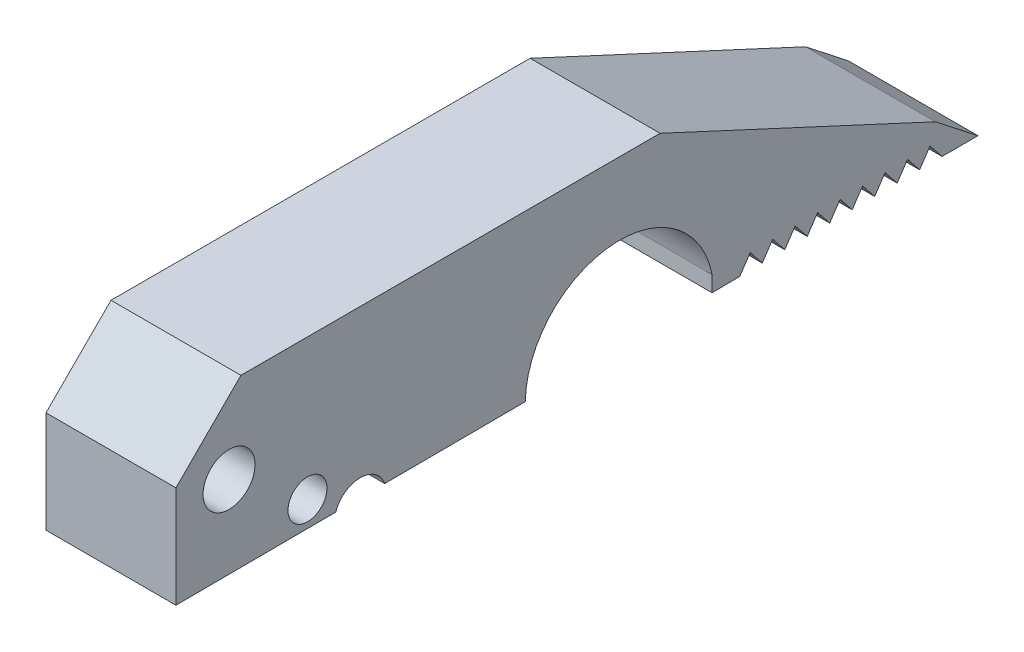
ISO-10303-21;
HEADER;
FILE_DESCRIPTION(('STEP AP214'),'2;1');
FILE_NAME('part.step','',(''),(''),'','','');
FILE_SCHEMA(('AUTOMOTIVE_DESIGN { 1 0 10303 214 1 1 1 1 }'));
ENDSEC;
DATA;
#1=APPLICATION_CONTEXT('core data for automotive mechanical design processes');
#2=APPLICATION_PROTOCOL_DEFINITION('international standard','automotive_design',2000,#1);
#3=PRODUCT_CONTEXT('',#1,'mechanical');
#4=PRODUCT('Part','Part','',(#3));
#5=PRODUCT_RELATED_PRODUCT_CATEGORY('part','',(#4));
#6=PRODUCT_DEFINITION_FORMATION('','',#4);
#7=PRODUCT_DEFINITION_CONTEXT('part definition',#1,'design');
#8=PRODUCT_DEFINITION('design','',#6,#7);
#9=PRODUCT_DEFINITION_SHAPE('','',#8);
#10=(LENGTH_UNIT() NAMED_UNIT(*) SI_UNIT(.MILLI.,.METRE.));
#11=(NAMED_UNIT(*) PLANE_ANGLE_UNIT() SI_UNIT($,.RADIAN.));
#12=(NAMED_UNIT(*) SI_UNIT($,.STERADIAN.) SOLID_ANGLE_UNIT());
#13=UNCERTAINTY_MEASURE_WITH_UNIT(LENGTH_MEASURE(1.E-05),#10,'distance_accuracy_value','');
#14=(GEOMETRIC_REPRESENTATION_CONTEXT(3) GLOBAL_UNCERTAINTY_ASSIGNED_CONTEXT((#13)) GLOBAL_UNIT_ASSIGNED_CONTEXT((#10,
#11,#12)) REPRESENTATION_CONTEXT('',''));
#15=CARTESIAN_POINT('',(0.,0.,0.));
#16=DIRECTION('',(0.,0.,1.));
#17=DIRECTION('',(1.,0.,0.));
#18=AXIS2_PLACEMENT_3D('',#15,#16,#17);
#19=CARTESIAN_POINT('',(10.,-1.40674556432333,-23.3495261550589));
#20=DIRECTION('',(-1.,0.,0.));
#21=DIRECTION('',(0.,0.,1.));
#22=AXIS2_PLACEMENT_3D('',#19,#20,#21);
#23=PLANE('',#22);
#24=DIRECTION('',(0.,0.,1.));
#25=VECTOR('',#24,1.);
#26=CARTESIAN_POINT('',(10.,11.4186627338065,10.7902319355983));
#27=LINE('',#26,#25);
#28=CARTESIAN_POINT('',(10.,11.4186627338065,-26.4654323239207));
#29=VERTEX_POINT('',#28);
#30=CARTESIAN_POINT('',(10.,11.4186627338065,5.79023193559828));
#31=VERTEX_POINT('',#30);
#32=EDGE_CURVE('E264',#29,#31,#27,.T.);
#33=ORIENTED_EDGE('',*,*,#32,.T.);
#34=DIRECTION('',(0.,0.707106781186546,-0.707106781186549));
#35=VECTOR('',#34,1.);
#36=CARTESIAN_POINT('',(10.,6.41866273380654,10.7902319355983));
#37=LINE('',#36,#35);
#38=CARTESIAN_POINT('',(10.,6.41866273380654,10.7902319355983));
#39=VERTEX_POINT('',#38);
#40=EDGE_CURVE('E11',#31,#39,#37,.F.);
#41=ORIENTED_EDGE('',*,*,#40,.T.);
#42=DIRECTION('',(0.,-1.,0.));
#43=VECTOR('',#42,1.);
#44=CARTESIAN_POINT('',(10.,1.41866273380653,10.7902319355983));
#45=LINE('',#44,#43);
#46=CARTESIAN_POINT('',(10.,-1.40674556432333,10.7902319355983));
#47=VERTEX_POINT('',#46);
#48=EDGE_CURVE('E253',#39,#47,#45,.T.);
#49=ORIENTED_EDGE('',*,*,#48,.T.);
#50=DIRECTION('',(0.,0.00465719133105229,-0.999989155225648));
#51=VECTOR('',#50,1.);
#52=CARTESIAN_POINT('',(10.,-1.40674556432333,10.7902319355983));
#53=LINE('',#52,#51);
#54=CARTESIAN_POINT('',(10.,-1.34949691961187,-1.5021605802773));
#55=VERTEX_POINT('',#54);
#56=EDGE_CURVE('E257',#47,#55,#53,.T.);
#57=ORIENTED_EDGE('',*,*,#56,.T.);
#58=CARTESIAN_POINT('',(10.,-1.99954769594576,-3.3935711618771));
#59=DIRECTION('',(-1.,0.,0.));
#60=DIRECTION('',(0.,0.,-1.));
#61=AXIS2_PLACEMENT_3D('',#58,#59,#60);
#62=CIRCLE('',#61,2.);
#63=CARTESIAN_POINT('',(10.,-1.33190798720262,-5.27884494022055));
#64=VERTEX_POINT('',#63);
#65=EDGE_CURVE('E281',#55,#64,#62,.T.);
#66=ORIENTED_EDGE('',*,*,#65,.T.);
#67=DIRECTION('',(0.,0.00465719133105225,-0.999989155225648));
#68=VECTOR('',#67,1.);
#69=CARTESIAN_POINT('',(10.,-1.33190798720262,-5.27884494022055));
#70=LINE('',#69,#68);
#71=CARTESIAN_POINT('',(10.,-1.2815478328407,-16.0921451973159));
#72=VERTEX_POINT('',#71);
#73=EDGE_CURVE('E284',#64,#72,#70,.T.);
#74=ORIENTED_EDGE('',*,*,#73,.T.);
#75=CARTESIAN_POINT('',(10.,-1.40674556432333,-23.3495261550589));
#76=DIRECTION('',(-1.,0.,0.));
#77=DIRECTION('',(0.,0.,1.));
#78=AXIS2_PLACEMENT_3D('',#75,#76,#77);
#79=CIRCLE('',#78,7.25846077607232);
#80=CARTESIAN_POINT('',(10.,0.000354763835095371,-30.4702930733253));
#81=VERTEX_POINT('',#80);
#82=EDGE_CURVE('E290',#72,#81,#79,.T.);
#83=ORIENTED_EDGE('',*,*,#82,.T.);
#84=DIRECTION('',(0.,-0.999999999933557,1.15275838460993E-05));
#85=VECTOR('',#84,1.);
#86=CARTESIAN_POINT('',(10.,-1.21458538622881,-30.4702790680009));
#87=LINE('',#86,#85);
#88=CARTESIAN_POINT('',(10.,-1.21458538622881,-30.4702790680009));
#89=VERTEX_POINT('',#88);
#90=EDGE_CURVE('E293',#81,#89,#87,.T.);
#91=ORIENTED_EDGE('',*,*,#90,.T.);
#92=DIRECTION('',(0.,0.0133625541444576,-0.999910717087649));
#93=VECTOR('',#92,1.);
#94=CARTESIAN_POINT('',(10.,-1.21458538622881,-30.4702790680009));
#95=LINE('',#94,#93);
#96=CARTESIAN_POINT('',(10.,-1.18611215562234,-32.6009112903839));
#97=VERTEX_POINT('',#96);
#98=EDGE_CURVE('E296',#89,#97,#95,.T.);
#99=ORIENTED_EDGE('',*,*,#98,.T.);
#100=DIRECTION('',(0.,0.828996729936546,-0.559253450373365));
#101=VECTOR('',#100,1.);
#102=CARTESIAN_POINT('',(10.,-1.18611215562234,-32.6009112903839));
#103=LINE('',#102,#101);
#104=CARTESIAN_POINT('',(10.,0.00290284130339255,-33.4030383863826));
#105=VERTEX_POINT('',#104);
#106=EDGE_CURVE('E299',#97,#105,#103,.T.);
#107=ORIENTED_EDGE('',*,*,#106,.T.);
#108=DIRECTION('',(0.,-0.782451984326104,-0.622710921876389));
#109=VECTOR('',#108,1.);
#110=CARTESIAN_POINT('',(10.,0.00290284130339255,-33.4030383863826));
#111=LINE('',#110,#109);
#112=CARTESIAN_POINT('',(10.,-1.16299287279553,-34.3309112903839));
#113=VERTEX_POINT('',#112);
#114=EDGE_CURVE('E302',#105,#113,#111,.T.);
#115=ORIENTED_EDGE('',*,*,#114,.T.);
#116=DIRECTION('',(0.,0.828996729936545,-0.559253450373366));
#117=VECTOR('',#116,1.);
#118=CARTESIAN_POINT('',(10.,-1.16299287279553,-34.3309112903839));
#119=LINE('',#118,#117);
#120=CARTESIAN_POINT('',(10.,0.0260221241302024,-35.1330383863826));
#121=VERTEX_POINT('',#120);
#122=EDGE_CURVE('E305',#113,#121,#119,.T.);
#123=ORIENTED_EDGE('',*,*,#122,.T.);
#124=DIRECTION('',(0.,-0.782451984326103,-0.62271092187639));
#125=VECTOR('',#124,1.);
#126=CARTESIAN_POINT('',(10.,0.0260221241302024,-35.1330383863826));
#127=LINE('',#126,#125);
#128=CARTESIAN_POINT('',(10.,-1.13987358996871,-36.0609112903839));
#129=VERTEX_POINT('',#128);
#130=EDGE_CURVE('E308',#121,#129,#127,.T.);
#131=ORIENTED_EDGE('',*,*,#130,.T.);
#132=DIRECTION('',(0.,0.828996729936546,-0.559253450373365));
#133=VECTOR('',#132,1.);
#134=CARTESIAN_POINT('',(10.,-1.13987358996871,-36.0609112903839));
#135=LINE('',#134,#133);
#136=CARTESIAN_POINT('',(10.,0.0491414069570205,-36.8630383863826));
#137=VERTEX_POINT('',#136);
#138=EDGE_CURVE('E311',#129,#137,#135,.T.);
#139=ORIENTED_EDGE('',*,*,#138,.T.);
#140=DIRECTION('',(0.,-0.782451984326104,-0.622710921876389));
#141=VECTOR('',#140,1.);
#142=CARTESIAN_POINT('',(10.,0.0491414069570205,-36.8630383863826));
#143=LINE('',#142,#141);
#144=CARTESIAN_POINT('',(10.,-1.1167543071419,-37.7909112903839));
#145=VERTEX_POINT('',#144);
#146=EDGE_CURVE('E314',#137,#145,#143,.T.);
#147=ORIENTED_EDGE('',*,*,#146,.T.);
#148=DIRECTION('',(0.,0.828996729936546,-0.559253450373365));
#149=VECTOR('',#148,1.);
#150=CARTESIAN_POINT('',(10.,-1.1167543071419,-37.7909112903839));
#151=LINE('',#150,#149);
#152=CARTESIAN_POINT('',(10.,0.0721545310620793,-38.5929667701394));
#153=VERTEX_POINT('',#152);
#154=EDGE_CURVE('E317',#145,#153,#151,.T.);
#155=ORIENTED_EDGE('',*,*,#154,.T.);
#156=DIRECTION('',(0.,-0.782451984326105,-0.622710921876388));
#157=VECTOR('',#156,1.);
#158=CARTESIAN_POINT('',(10.,0.0721545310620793,-38.5929667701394));
#159=LINE('',#158,#157);
#160=CARTESIAN_POINT('',(10.,-1.09363708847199,-39.5207568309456));
#161=VERTEX_POINT('',#160);
#162=EDGE_CURVE('E320',#153,#161,#159,.T.);
#163=ORIENTED_EDGE('',*,*,#162,.T.);
#164=DIRECTION('',(0.,0.828996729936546,-0.559253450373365));
#165=VECTOR('',#164,1.);
#166=CARTESIAN_POINT('',(10.,-1.09363708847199,-39.5207568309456));
#167=LINE('',#166,#165);
#168=CARTESIAN_POINT('',(10.,0.0952717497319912,-40.322812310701));
#169=VERTEX_POINT('',#168);
#170=EDGE_CURVE('E323',#161,#169,#167,.T.);
#171=ORIENTED_EDGE('',*,*,#170,.T.);
#172=DIRECTION('',(0.,-0.782451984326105,-0.622710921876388));
#173=VECTOR('',#172,1.);
#174=CARTESIAN_POINT('',(10.,0.0952717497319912,-40.322812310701));
#175=LINE('',#174,#173);
#176=CARTESIAN_POINT('',(10.,-1.07051986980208,-41.2506023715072));
#177=VERTEX_POINT('',#176);
#178=EDGE_CURVE('E326',#169,#177,#175,.T.);
#179=ORIENTED_EDGE('',*,*,#178,.T.);
#180=DIRECTION('',(0.,0.828996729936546,-0.559253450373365));
#181=VECTOR('',#180,1.);
#182=CARTESIAN_POINT('',(10.,-1.07051986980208,-41.2506023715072));
#183=LINE('',#182,#181);
#184=CARTESIAN_POINT('',(10.,0.118388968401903,-42.0526578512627));
#185=VERTEX_POINT('',#184);
#186=EDGE_CURVE('E329',#177,#185,#183,.T.);
#187=ORIENTED_EDGE('',*,*,#186,.T.);
#188=DIRECTION('',(0.,-0.782451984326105,-0.622710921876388));
#189=VECTOR('',#188,1.);
#190=CARTESIAN_POINT('',(10.,0.118388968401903,-42.0526578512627));
#191=LINE('',#190,#189);
#192=CARTESIAN_POINT('',(10.,-1.04740265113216,-42.9804479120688));
#193=VERTEX_POINT('',#192);
#194=EDGE_CURVE('E332',#185,#193,#191,.T.);
#195=ORIENTED_EDGE('',*,*,#194,.T.);
#196=DIRECTION('',(0.,0.828996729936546,-0.559253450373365));
#197=VECTOR('',#196,1.);
#198=CARTESIAN_POINT('',(10.,-1.04740265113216,-42.9804479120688));
#199=LINE('',#198,#197);
#200=CARTESIAN_POINT('',(10.,0.141506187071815,-43.7825033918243));
#201=VERTEX_POINT('',#200);
#202=EDGE_CURVE('E335',#193,#201,#199,.T.);
#203=ORIENTED_EDGE('',*,*,#202,.T.);
#204=DIRECTION('',(0.,-0.782451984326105,-0.622710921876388));
#205=VECTOR('',#204,1.);
#206=CARTESIAN_POINT('',(10.,0.141506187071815,-43.7825033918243));
#207=LINE('',#206,#205);
#208=CARTESIAN_POINT('',(10.,-1.02428543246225,-44.7102934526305));
#209=VERTEX_POINT('',#208);
#210=EDGE_CURVE('E338',#201,#209,#207,.T.);
#211=ORIENTED_EDGE('',*,*,#210,.T.);
#212=DIRECTION('',(0.,0.828996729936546,-0.559253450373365));
#213=VECTOR('',#212,1.);
#214=CARTESIAN_POINT('',(10.,-1.02428543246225,-44.7102934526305));
#215=LINE('',#214,#213);
#216=CARTESIAN_POINT('',(10.,0.164623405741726,-45.5123489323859));
#217=VERTEX_POINT('',#216);
#218=EDGE_CURVE('E341',#209,#217,#215,.T.);
#219=ORIENTED_EDGE('',*,*,#218,.T.);
#220=DIRECTION('',(0.,-0.782451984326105,-0.622710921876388));
#221=VECTOR('',#220,1.);
#222=CARTESIAN_POINT('',(10.,0.164623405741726,-45.5123489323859));
#223=LINE('',#222,#221);
#224=CARTESIAN_POINT('',(10.,-1.00116821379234,-46.4401389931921));
#225=VERTEX_POINT('',#224);
#226=EDGE_CURVE('E344',#217,#225,#223,.T.);
#227=ORIENTED_EDGE('',*,*,#226,.T.);
#228=DIRECTION('',(0.,0.828996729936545,-0.559253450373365));
#229=VECTOR('',#228,1.);
#230=CARTESIAN_POINT('',(10.,-1.00116821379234,-46.4401389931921));
#231=LINE('',#230,#229);
#232=CARTESIAN_POINT('',(10.,0.187740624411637,-47.2421944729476));
#233=VERTEX_POINT('',#232);
#234=EDGE_CURVE('E347',#225,#233,#231,.T.);
#235=ORIENTED_EDGE('',*,*,#234,.T.);
#236=DIRECTION('',(0.,-0.782451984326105,-0.622710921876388));
#237=VECTOR('',#236,1.);
#238=CARTESIAN_POINT('',(10.,0.187740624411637,-47.2421944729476));
#239=LINE('',#238,#237);
#240=CARTESIAN_POINT('',(10.,-0.978050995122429,-48.1699845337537));
#241=VERTEX_POINT('',#240);
#242=EDGE_CURVE('E350',#233,#241,#239,.T.);
#243=ORIENTED_EDGE('',*,*,#242,.T.);
#244=DIRECTION('',(0.,0.0133625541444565,-0.999910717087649));
#245=VECTOR('',#244,1.);
#246=CARTESIAN_POINT('',(10.,-0.978050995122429,-48.1699845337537));
#247=LINE('',#246,#245);
#248=CARTESIAN_POINT('',(10.,-0.974612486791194,-48.4272857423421));
#249=VERTEX_POINT('',#248);
#250=EDGE_CURVE('E353',#241,#249,#247,.T.);
#251=ORIENTED_EDGE('',*,*,#250,.T.);
#252=DIRECTION('',(0.,0.,-1.));
#253=VECTOR('',#252,1.);
#254=CARTESIAN_POINT('',(10.,-0.974612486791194,-48.4272857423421));
#255=LINE('',#254,#253);
#256=CARTESIAN_POINT('',(10.,-0.974612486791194,-50.9316525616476));
#257=VERTEX_POINT('',#256);
#258=EDGE_CURVE('E356',#249,#257,#255,.T.);
#259=ORIENTED_EDGE('',*,*,#258,.T.);
#260=DIRECTION('',(0.,0.61648590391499,0.787365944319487));
#261=VECTOR('',#260,1.);
#262=CARTESIAN_POINT('',(10.,1.59354352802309,-47.6516447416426));
#263=LINE('',#262,#261);
#264=CARTESIAN_POINT('',(10.,1.59354352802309,-47.6516447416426));
#265=VERTEX_POINT('',#264);
#266=EDGE_CURVE('E359',#257,#265,#263,.T.);
#267=ORIENTED_EDGE('',*,*,#266,.T.);
#268=DIRECTION('',(0.,0.420711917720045,0.907194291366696));
#269=VECTOR('',#268,1.);
#270=CARTESIAN_POINT('',(10.,1.59354352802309,-47.6516447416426));
#271=LINE('',#270,#269);
#272=EDGE_CURVE('E362',#265,#29,#271,.T.);
#273=ORIENTED_EDGE('',*,*,#272,.T.);
#274=EDGE_LOOP('',(#33,#41,#49,#57,#66,#74,#83,#91,#99,#107,#115,#123,#131,#139,#147,#155,#163,
#171,#179,#187,#195,#203,#211,#219,#227,#235,#243,#251,#259,#267,#273));
#275=FACE_BOUND('',#274,.T.);
#276=CARTESIAN_POINT('',(10.,0.593254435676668,0.667060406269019));
#277=DIRECTION('',(1.,0.,0.));
#278=DIRECTION('',(0.,0.,-1.));
#279=AXIS2_PLACEMENT_3D('',#276,#277,#278);
#280=CIRCLE('',#279,1.5);
#281=CARTESIAN_POINT('',(10.,0.593254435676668,-0.832939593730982));
#282=VERTEX_POINT('',#281);
#283=EDGE_CURVE('E369',#282,#282,#280,.T.);
#284=ORIENTED_EDGE('',*,*,#283,.F.);
#285=EDGE_LOOP('',(#284));
#286=FACE_BOUND('',#285,.T.);
#287=CARTESIAN_POINT('',(10.,4.93497379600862,6.70346901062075));
#288=DIRECTION('',(1.,0.,0.));
#289=DIRECTION('',(0.,0.,-1.));
#290=AXIS2_PLACEMENT_3D('',#287,#288,#289);
#291=CIRCLE('',#290,2.);
#292=CARTESIAN_POINT('',(10.,4.93497379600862,4.70346901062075));
#293=VERTEX_POINT('',#292);
#294=EDGE_CURVE('E712',#293,#293,#291,.T.);
#295=ORIENTED_EDGE('',*,*,#294,.F.);
#296=EDGE_LOOP('',(#295));
#297=FACE_BOUND('',#296,.T.);
#298=ADVANCED_FACE('F49',(#275,#286,#297),#23,.F.);
#299=CARTESIAN_POINT('',(0.,-1.40674556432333,-23.3495261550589));
#300=DIRECTION('',(-1.,0.,0.));
#301=DIRECTION('',(0.,0.,1.));
#302=AXIS2_PLACEMENT_3D('',#299,#300,#301);
#303=PLANE('',#302);
#304=CARTESIAN_POINT('',(0.,0.593254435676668,0.667060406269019));
#305=DIRECTION('',(1.,0.,0.));
#306=DIRECTION('',(0.,0.,-1.));
#307=AXIS2_PLACEMENT_3D('',#304,#305,#306);
#308=CIRCLE('',#307,1.5);
#309=CARTESIAN_POINT('',(0.,0.593254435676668,-0.832939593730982));
#310=VERTEX_POINT('',#309);
#311=EDGE_CURVE('E708',#310,#310,#308,.T.);
#312=ORIENTED_EDGE('',*,*,#311,.T.);
#313=EDGE_LOOP('',(#312));
#314=FACE_BOUND('',#313,.T.);
#315=DIRECTION('',(0.,-1.,0.));
#316=VECTOR('',#315,1.);
#317=CARTESIAN_POINT('',(0.,-1.40674556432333,10.7902319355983));
#318=LINE('',#317,#316);
#319=CARTESIAN_POINT('',(0.,6.41866273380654,10.7902319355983));
#320=VERTEX_POINT('',#319);
#321=CARTESIAN_POINT('',(0.,-1.40674556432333,10.7902319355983));
#322=VERTEX_POINT('',#321);
#323=EDGE_CURVE('E269',#320,#322,#318,.T.);
#324=ORIENTED_EDGE('',*,*,#323,.F.);
#325=DIRECTION('',(0.,-0.707106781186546,0.707106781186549));
#326=VECTOR('',#325,1.);
#327=CARTESIAN_POINT('',(0.,19.5758376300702,-2.36694296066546));
#328=LINE('',#327,#326);
#329=CARTESIAN_POINT('',(0.,11.4186627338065,5.79023193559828));
#330=VERTEX_POINT('',#329);
#331=EDGE_CURVE('E73',#320,#330,#328,.F.);
#332=ORIENTED_EDGE('',*,*,#331,.T.);
#333=DIRECTION('',(0.,0.,1.));
#334=VECTOR('',#333,1.);
#335=CARTESIAN_POINT('',(0.,11.4186627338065,10.7902319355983));
#336=LINE('',#335,#334);
#337=CARTESIAN_POINT('',(0.,11.4186627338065,-26.4654323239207));
#338=VERTEX_POINT('',#337);
#339=EDGE_CURVE('E366',#338,#330,#336,.T.);
#340=ORIENTED_EDGE('',*,*,#339,.F.);
#341=DIRECTION('',(0.,0.420711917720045,0.907194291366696));
#342=VECTOR('',#341,1.);
#343=CARTESIAN_POINT('',(0.,1.59354352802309,-47.6516447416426));
#344=LINE('',#343,#342);
#345=CARTESIAN_POINT('',(0.,1.59354352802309,-47.6516447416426));
#346=VERTEX_POINT('',#345);
#347=EDGE_CURVE('E453',#346,#338,#344,.T.);
#348=ORIENTED_EDGE('',*,*,#347,.F.);
#349=DIRECTION('',(0.,0.61648590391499,0.787365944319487));
#350=VECTOR('',#349,1.);
#351=CARTESIAN_POINT('',(0.,1.59354352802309,-47.6516447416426));
#352=LINE('',#351,#350);
#353=CARTESIAN_POINT('',(0.,-0.974612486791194,-50.9316525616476));
#354=VERTEX_POINT('',#353);
#355=EDGE_CURVE('E450',#354,#346,#352,.T.);
#356=ORIENTED_EDGE('',*,*,#355,.F.);
#357=DIRECTION('',(0.,0.,-1.));
#358=VECTOR('',#357,1.);
#359=CARTESIAN_POINT('',(0.,-0.974612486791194,-48.4272857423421));
#360=LINE('',#359,#358);
#361=CARTESIAN_POINT('',(0.,-0.974612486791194,-48.4272857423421));
#362=VERTEX_POINT('',#361);
#363=EDGE_CURVE('E447',#362,#354,#360,.T.);
#364=ORIENTED_EDGE('',*,*,#363,.F.);
#365=DIRECTION('',(0.,0.0133625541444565,-0.999910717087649));
#366=VECTOR('',#365,1.);
#367=CARTESIAN_POINT('',(0.,-0.978050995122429,-48.1699845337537));
#368=LINE('',#367,#366);
#369=CARTESIAN_POINT('',(0.,-0.978050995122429,-48.1699845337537));
#370=VERTEX_POINT('',#369);
#371=EDGE_CURVE('E444',#370,#362,#368,.T.);
#372=ORIENTED_EDGE('',*,*,#371,.F.);
#373=DIRECTION('',(0.,-0.782451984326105,-0.622710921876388));
#374=VECTOR('',#373,1.);
#375=CARTESIAN_POINT('',(0.,0.187740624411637,-47.2421944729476));
#376=LINE('',#375,#374);
#377=CARTESIAN_POINT('',(0.,0.187740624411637,-47.2421944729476));
#378=VERTEX_POINT('',#377);
#379=EDGE_CURVE('E441',#378,#370,#376,.T.);
#380=ORIENTED_EDGE('',*,*,#379,.F.);
#381=DIRECTION('',(0.,0.828996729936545,-0.559253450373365));
#382=VECTOR('',#381,1.);
#383=CARTESIAN_POINT('',(0.,-1.00116821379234,-46.4401389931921));
#384=LINE('',#383,#382);
#385=CARTESIAN_POINT('',(0.,-1.00116821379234,-46.4401389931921));
#386=VERTEX_POINT('',#385);
#387=EDGE_CURVE('E438',#386,#378,#384,.T.);
#388=ORIENTED_EDGE('',*,*,#387,.F.);
#389=DIRECTION('',(0.,-0.782451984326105,-0.622710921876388));
#390=VECTOR('',#389,1.);
#391=CARTESIAN_POINT('',(0.,0.164623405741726,-45.5123489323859));
#392=LINE('',#391,#390);
#393=CARTESIAN_POINT('',(0.,0.164623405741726,-45.5123489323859));
#394=VERTEX_POINT('',#393);
#395=EDGE_CURVE('E435',#394,#386,#392,.T.);
#396=ORIENTED_EDGE('',*,*,#395,.F.);
#397=DIRECTION('',(0.,0.828996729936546,-0.559253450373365));
#398=VECTOR('',#397,1.);
#399=CARTESIAN_POINT('',(0.,-1.02428543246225,-44.7102934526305));
#400=LINE('',#399,#398);
#401=CARTESIAN_POINT('',(0.,-1.02428543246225,-44.7102934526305));
#402=VERTEX_POINT('',#401);
#403=EDGE_CURVE('E432',#402,#394,#400,.T.);
#404=ORIENTED_EDGE('',*,*,#403,.F.);
#405=DIRECTION('',(0.,-0.782451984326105,-0.622710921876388));
#406=VECTOR('',#405,1.);
#407=CARTESIAN_POINT('',(0.,0.141506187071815,-43.7825033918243));
#408=LINE('',#407,#406);
#409=CARTESIAN_POINT('',(0.,0.141506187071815,-43.7825033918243));
#410=VERTEX_POINT('',#409);
#411=EDGE_CURVE('E429',#410,#402,#408,.T.);
#412=ORIENTED_EDGE('',*,*,#411,.F.);
#413=DIRECTION('',(0.,0.828996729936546,-0.559253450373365));
#414=VECTOR('',#413,1.);
#415=CARTESIAN_POINT('',(0.,-1.04740265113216,-42.9804479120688));
#416=LINE('',#415,#414);
#417=CARTESIAN_POINT('',(0.,-1.04740265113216,-42.9804479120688));
#418=VERTEX_POINT('',#417);
#419=EDGE_CURVE('E426',#418,#410,#416,.T.);
#420=ORIENTED_EDGE('',*,*,#419,.F.);
#421=DIRECTION('',(0.,-0.782451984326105,-0.622710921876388));
#422=VECTOR('',#421,1.);
#423=CARTESIAN_POINT('',(0.,0.118388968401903,-42.0526578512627));
#424=LINE('',#423,#422);
#425=CARTESIAN_POINT('',(0.,0.118388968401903,-42.0526578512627));
#426=VERTEX_POINT('',#425);
#427=EDGE_CURVE('E423',#426,#418,#424,.T.);
#428=ORIENTED_EDGE('',*,*,#427,.F.);
#429=DIRECTION('',(0.,0.828996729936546,-0.559253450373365));
#430=VECTOR('',#429,1.);
#431=CARTESIAN_POINT('',(0.,-1.07051986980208,-41.2506023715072));
#432=LINE('',#431,#430);
#433=CARTESIAN_POINT('',(0.,-1.07051986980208,-41.2506023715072));
#434=VERTEX_POINT('',#433);
#435=EDGE_CURVE('E420',#434,#426,#432,.T.);
#436=ORIENTED_EDGE('',*,*,#435,.F.);
#437=DIRECTION('',(0.,-0.782451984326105,-0.622710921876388));
#438=VECTOR('',#437,1.);
#439=CARTESIAN_POINT('',(0.,0.0952717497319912,-40.322812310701));
#440=LINE('',#439,#438);
#441=CARTESIAN_POINT('',(0.,0.0952717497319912,-40.322812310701));
#442=VERTEX_POINT('',#441);
#443=EDGE_CURVE('E417',#442,#434,#440,.T.);
#444=ORIENTED_EDGE('',*,*,#443,.F.);
#445=DIRECTION('',(0.,0.828996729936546,-0.559253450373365));
#446=VECTOR('',#445,1.);
#447=CARTESIAN_POINT('',(0.,-1.09363708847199,-39.5207568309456));
#448=LINE('',#447,#446);
#449=CARTESIAN_POINT('',(0.,-1.09363708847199,-39.5207568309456));
#450=VERTEX_POINT('',#449);
#451=EDGE_CURVE('E414',#450,#442,#448,.T.);
#452=ORIENTED_EDGE('',*,*,#451,.F.);
#453=DIRECTION('',(0.,-0.782451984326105,-0.622710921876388));
#454=VECTOR('',#453,1.);
#455=CARTESIAN_POINT('',(0.,0.0721545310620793,-38.5929667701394));
#456=LINE('',#455,#454);
#457=CARTESIAN_POINT('',(0.,0.0721545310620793,-38.5929667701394));
#458=VERTEX_POINT('',#457);
#459=EDGE_CURVE('E411',#458,#450,#456,.T.);
#460=ORIENTED_EDGE('',*,*,#459,.F.);
#461=DIRECTION('',(0.,0.828996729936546,-0.559253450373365));
#462=VECTOR('',#461,1.);
#463=CARTESIAN_POINT('',(0.,-1.1167543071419,-37.7909112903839));
#464=LINE('',#463,#462);
#465=CARTESIAN_POINT('',(0.,-1.1167543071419,-37.7909112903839));
#466=VERTEX_POINT('',#465);
#467=EDGE_CURVE('E408',#466,#458,#464,.T.);
#468=ORIENTED_EDGE('',*,*,#467,.F.);
#469=DIRECTION('',(0.,-0.782451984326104,-0.622710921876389));
#470=VECTOR('',#469,1.);
#471=CARTESIAN_POINT('',(0.,0.0491414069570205,-36.8630383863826));
#472=LINE('',#471,#470);
#473=CARTESIAN_POINT('',(0.,0.0491414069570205,-36.8630383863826));
#474=VERTEX_POINT('',#473);
#475=EDGE_CURVE('E405',#474,#466,#472,.T.);
#476=ORIENTED_EDGE('',*,*,#475,.F.);
#477=DIRECTION('',(0.,0.828996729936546,-0.559253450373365));
#478=VECTOR('',#477,1.);
#479=CARTESIAN_POINT('',(0.,-1.13987358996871,-36.0609112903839));
#480=LINE('',#479,#478);
#481=CARTESIAN_POINT('',(0.,-1.13987358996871,-36.0609112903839));
#482=VERTEX_POINT('',#481);
#483=EDGE_CURVE('E402',#482,#474,#480,.T.);
#484=ORIENTED_EDGE('',*,*,#483,.F.);
#485=DIRECTION('',(0.,-0.782451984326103,-0.62271092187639));
#486=VECTOR('',#485,1.);
#487=CARTESIAN_POINT('',(0.,0.0260221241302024,-35.1330383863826));
#488=LINE('',#487,#486);
#489=CARTESIAN_POINT('',(0.,0.0260221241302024,-35.1330383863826));
#490=VERTEX_POINT('',#489);
#491=EDGE_CURVE('E399',#490,#482,#488,.T.);
#492=ORIENTED_EDGE('',*,*,#491,.F.);
#493=DIRECTION('',(0.,0.828996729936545,-0.559253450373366));
#494=VECTOR('',#493,1.);
#495=CARTESIAN_POINT('',(0.,-1.16299287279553,-34.3309112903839));
#496=LINE('',#495,#494);
#497=CARTESIAN_POINT('',(0.,-1.16299287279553,-34.3309112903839));
#498=VERTEX_POINT('',#497);
#499=EDGE_CURVE('E396',#498,#490,#496,.T.);
#500=ORIENTED_EDGE('',*,*,#499,.F.);
#501=DIRECTION('',(0.,-0.782451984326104,-0.622710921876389));
#502=VECTOR('',#501,1.);
#503=CARTESIAN_POINT('',(0.,0.00290284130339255,-33.4030383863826));
#504=LINE('',#503,#502);
#505=CARTESIAN_POINT('',(0.,0.00290284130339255,-33.4030383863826));
#506=VERTEX_POINT('',#505);
#507=EDGE_CURVE('E393',#506,#498,#504,.T.);
#508=ORIENTED_EDGE('',*,*,#507,.F.);
#509=DIRECTION('',(0.,0.828996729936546,-0.559253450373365));
#510=VECTOR('',#509,1.);
#511=CARTESIAN_POINT('',(0.,-1.18611215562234,-32.6009112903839));
#512=LINE('',#511,#510);
#513=CARTESIAN_POINT('',(0.,-1.18611215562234,-32.6009112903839));
#514=VERTEX_POINT('',#513);
#515=EDGE_CURVE('E390',#514,#506,#512,.T.);
#516=ORIENTED_EDGE('',*,*,#515,.F.);
#517=DIRECTION('',(0.,0.0133625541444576,-0.999910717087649));
#518=VECTOR('',#517,1.);
#519=CARTESIAN_POINT('',(0.,-1.21458538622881,-30.4702790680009));
#520=LINE('',#519,#518);
#521=CARTESIAN_POINT('',(0.,-1.21458538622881,-30.4702790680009));
#522=VERTEX_POINT('',#521);
#523=EDGE_CURVE('E387',#522,#514,#520,.T.);
#524=ORIENTED_EDGE('',*,*,#523,.F.);
#525=DIRECTION('',(0.,-0.999999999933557,1.15275838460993E-05));
#526=VECTOR('',#525,1.);
#527=CARTESIAN_POINT('',(0.,-1.21458538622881,-30.4702790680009));
#528=LINE('',#527,#526);
#529=CARTESIAN_POINT('',(0.,0.000354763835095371,-30.4702930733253));
#530=VERTEX_POINT('',#529);
#531=EDGE_CURVE('E384',#530,#522,#528,.T.);
#532=ORIENTED_EDGE('',*,*,#531,.F.);
#533=CARTESIAN_POINT('',(0.,-1.40674556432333,-23.3495261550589));
#534=DIRECTION('',(-1.,0.,0.));
#535=DIRECTION('',(0.,0.,1.));
#536=AXIS2_PLACEMENT_3D('',#533,#534,#535);
#537=CIRCLE('',#536,7.25846077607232);
#538=CARTESIAN_POINT('',(0.,-1.2815478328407,-16.0921451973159));
#539=VERTEX_POINT('',#538);
#540=EDGE_CURVE('E381',#539,#530,#537,.T.);
#541=ORIENTED_EDGE('',*,*,#540,.F.);
#542=DIRECTION('',(0.,0.00465719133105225,-0.999989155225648));
#543=VECTOR('',#542,1.);
#544=CARTESIAN_POINT('',(0.,-1.33190798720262,-5.27884494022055));
#545=LINE('',#544,#543);
#546=CARTESIAN_POINT('',(0.,-1.33190798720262,-5.27884494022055));
#547=VERTEX_POINT('',#546);
#548=EDGE_CURVE('E378',#547,#539,#545,.T.);
#549=ORIENTED_EDGE('',*,*,#548,.F.);
#550=CARTESIAN_POINT('',(0.,-1.99954769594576,-3.3935711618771));
#551=DIRECTION('',(-1.,0.,0.));
#552=DIRECTION('',(0.,0.,1.));
#553=AXIS2_PLACEMENT_3D('',#550,#551,#552);
#554=CIRCLE('',#553,2.);
#555=CARTESIAN_POINT('',(0.,-1.34949691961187,-1.5021605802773));
#556=VERTEX_POINT('',#555);
#557=EDGE_CURVE('E375',#556,#547,#554,.T.);
#558=ORIENTED_EDGE('',*,*,#557,.F.);
#559=DIRECTION('',(0.,0.00465719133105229,-0.999989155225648));
#560=VECTOR('',#559,1.);
#561=CARTESIAN_POINT('',(0.,-1.40674556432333,10.7902319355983));
#562=LINE('',#561,#560);
#563=EDGE_CURVE('E372',#322,#556,#562,.T.);
#564=ORIENTED_EDGE('',*,*,#563,.F.);
#565=EDGE_LOOP('',(#324,#332,#340,#348,#356,#364,#372,#380,#388,#396,#404,#412,#420,#428,#436,
#444,#452,#460,#468,#476,#484,#492,#500,#508,#516,#524,#532,#541,#549,#558,#564));
#566=FACE_BOUND('',#565,.T.);
#567=CARTESIAN_POINT('',(0.,4.93497379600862,6.70346901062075));
#568=DIRECTION('',(1.,0.,0.));
#569=DIRECTION('',(0.,0.,-1.));
#570=AXIS2_PLACEMENT_3D('',#567,#568,#569);
#571=CIRCLE('',#570,2.);
#572=CARTESIAN_POINT('',(0.,4.93497379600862,4.70346901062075));
#573=VERTEX_POINT('',#572);
#574=EDGE_CURVE('E716',#573,#573,#571,.T.);
#575=ORIENTED_EDGE('',*,*,#574,.T.);
#576=EDGE_LOOP('',(#575));
#577=FACE_BOUND('',#576,.T.);
#578=ADVANCED_FACE('F570',(#314,#566,#577),#303,.T.);
#579=CARTESIAN_POINT('',(10.,11.4186627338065,10.7902319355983));
#580=DIRECTION('',(0.,-1.,0.));
#581=DIRECTION('',(0.,0.,-1.));
#582=AXIS2_PLACEMENT_3D('',#579,#580,#581);
#583=PLANE('',#582);
#584=ORIENTED_EDGE('',*,*,#339,.T.);
#585=DIRECTION('',(1.,0.,0.));
#586=VECTOR('',#585,1.);
#587=CARTESIAN_POINT('',(10.,11.4186627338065,5.79023193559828));
#588=LINE('',#587,#586);
#589=EDGE_CURVE('E59',#330,#31,#588,.T.);
#590=ORIENTED_EDGE('',*,*,#589,.T.);
#591=ORIENTED_EDGE('',*,*,#32,.F.);
#592=DIRECTION('',(-1.,0.,0.));
#593=VECTOR('',#592,1.);
#594=CARTESIAN_POINT('',(10.,11.4186627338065,-26.4654323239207));
#595=LINE('',#594,#593);
#596=EDGE_CURVE('E365',#29,#338,#595,.T.);
#597=ORIENTED_EDGE('',*,*,#596,.T.);
#598=EDGE_LOOP('',(#584,#590,#591,#597));
#599=FACE_BOUND('',#598,.T.);
#600=ADVANCED_FACE('F705',(#599),#583,.F.);
#601=CARTESIAN_POINT('',(10.,-1.40674556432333,10.7902319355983));
#602=DIRECTION('',(0.,0.,-1.));
#603=DIRECTION('',(0.,1.,0.));
#604=AXIS2_PLACEMENT_3D('',#601,#602,#603);
#605=PLANE('',#604);
#606=ORIENTED_EDGE('',*,*,#48,.F.);
#607=DIRECTION('',(-1.,0.,0.));
#608=VECTOR('',#607,1.);
#609=CARTESIAN_POINT('',(10.,6.41866273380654,10.7902319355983));
#610=LINE('',#609,#608);
#611=EDGE_CURVE('E274',#39,#320,#610,.T.);
#612=ORIENTED_EDGE('',*,*,#611,.T.);
#613=ORIENTED_EDGE('',*,*,#323,.T.);
#614=DIRECTION('',(-1.,0.,0.));
#615=VECTOR('',#614,1.);
#616=CARTESIAN_POINT('',(10.,-1.40674556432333,10.7902319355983));
#617=LINE('',#616,#615);
#618=EDGE_CURVE('E267',#47,#322,#617,.T.);
#619=ORIENTED_EDGE('',*,*,#618,.F.);
#620=EDGE_LOOP('',(#606,#612,#613,#619));
#621=FACE_BOUND('',#620,.T.);
#622=ADVANCED_FACE('F268',(#621),#605,.F.);
#623=CARTESIAN_POINT('',(10.,-1.40674556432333,10.7902319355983));
#624=DIRECTION('',(0.,0.999989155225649,0.00465719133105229));
#625=DIRECTION('',(0.,-0.00465719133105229,0.999989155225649));
#626=AXIS2_PLACEMENT_3D('',#623,#624,#625);
#627=PLANE('',#626);
#628=ORIENTED_EDGE('',*,*,#563,.T.);
#629=DIRECTION('',(-1.,0.,0.));
#630=VECTOR('',#629,1.);
#631=CARTESIAN_POINT('',(10.,-1.34949691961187,-1.5021605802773));
#632=LINE('',#631,#630);
#633=EDGE_CURVE('E275',#55,#556,#632,.T.);
#634=ORIENTED_EDGE('',*,*,#633,.F.);
#635=ORIENTED_EDGE('',*,*,#56,.F.);
#636=ORIENTED_EDGE('',*,*,#618,.T.);
#637=EDGE_LOOP('',(#628,#634,#635,#636));
#638=FACE_BOUND('',#637,.T.);
#639=ADVANCED_FACE('F277',(#638),#627,.F.);
#640=CARTESIAN_POINT('',(10.,-1.99954769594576,-3.3935711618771));
#641=DIRECTION('',(-1.,0.,0.));
#642=DIRECTION('',(0.,0.,1.));
#643=AXIS2_PLACEMENT_3D('',#640,#641,#642);
#644=CYLINDRICAL_SURFACE('',#643,2.);
#645=ORIENTED_EDGE('',*,*,#557,.T.);
#646=DIRECTION('',(-1.,0.,0.));
#647=VECTOR('',#646,1.);
#648=CARTESIAN_POINT('',(10.,-1.33190798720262,-5.27884494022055));
#649=LINE('',#648,#647);
#650=EDGE_CURVE('E559',#64,#547,#649,.T.);
#651=ORIENTED_EDGE('',*,*,#650,.F.);
#652=ORIENTED_EDGE('',*,*,#65,.F.);
#653=ORIENTED_EDGE('',*,*,#633,.T.);
#654=EDGE_LOOP('',(#645,#651,#652,#653));
#655=FACE_BOUND('',#654,.T.);
#656=ADVANCED_FACE('F574',(#655),#644,.F.);
#657=CARTESIAN_POINT('',(10.,-1.33190798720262,-5.27884494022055));
#658=DIRECTION('',(0.,0.999989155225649,0.00465719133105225));
#659=DIRECTION('',(0.,-0.00465719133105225,0.999989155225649));
#660=AXIS2_PLACEMENT_3D('',#657,#658,#659);
#661=PLANE('',#660);
#662=ORIENTED_EDGE('',*,*,#548,.T.);
#663=DIRECTION('',(-1.,0.,0.));
#664=VECTOR('',#663,1.);
#665=CARTESIAN_POINT('',(10.,-1.2815478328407,-16.0921451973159));
#666=LINE('',#665,#664);
#667=EDGE_CURVE('E555',#72,#539,#666,.T.);
#668=ORIENTED_EDGE('',*,*,#667,.F.);
#669=ORIENTED_EDGE('',*,*,#73,.F.);
#670=ORIENTED_EDGE('',*,*,#650,.T.);
#671=EDGE_LOOP('',(#662,#668,#669,#670));
#672=FACE_BOUND('',#671,.T.);
#673=ADVANCED_FACE('F581',(#672),#661,.F.);
#674=CARTESIAN_POINT('',(10.,-1.40674556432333,-23.3495261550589));
#675=DIRECTION('',(-1.,0.,0.));
#676=DIRECTION('',(0.,0.,1.));
#677=AXIS2_PLACEMENT_3D('',#674,#675,#676);
#678=CYLINDRICAL_SURFACE('',#677,7.25846077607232);
#679=ORIENTED_EDGE('',*,*,#540,.T.);
#680=DIRECTION('',(-1.,0.,0.));
#681=VECTOR('',#680,1.);
#682=CARTESIAN_POINT('',(10.,0.000354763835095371,-30.4702930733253));
#683=LINE('',#682,#681);
#684=EDGE_CURVE('E551',#81,#530,#683,.T.);
#685=ORIENTED_EDGE('',*,*,#684,.F.);
#686=ORIENTED_EDGE('',*,*,#82,.F.);
#687=ORIENTED_EDGE('',*,*,#667,.T.);
#688=EDGE_LOOP('',(#679,#685,#686,#687));
#689=FACE_BOUND('',#688,.T.);
#690=ADVANCED_FACE('F584',(#689),#678,.F.);
#691=CARTESIAN_POINT('',(10.,-1.21458538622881,-30.4702790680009));
#692=DIRECTION('',(0.,-1.15275838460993E-05,-0.999999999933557));
#693=DIRECTION('',(0.,0.999999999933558,-1.15275838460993E-05));
#694=AXIS2_PLACEMENT_3D('',#691,#692,#693);
#695=PLANE('',#694);
#696=ORIENTED_EDGE('',*,*,#531,.T.);
#697=DIRECTION('',(-1.,0.,0.));
#698=VECTOR('',#697,1.);
#699=CARTESIAN_POINT('',(10.,-1.21458538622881,-30.4702790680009));
#700=LINE('',#699,#698);
#701=EDGE_CURVE('E547',#89,#522,#700,.T.);
#702=ORIENTED_EDGE('',*,*,#701,.F.);
#703=ORIENTED_EDGE('',*,*,#90,.F.);
#704=ORIENTED_EDGE('',*,*,#684,.T.);
#705=EDGE_LOOP('',(#696,#702,#703,#704));
#706=FACE_BOUND('',#705,.T.);
#707=ADVANCED_FACE('F589',(#706),#695,.F.);
#708=CARTESIAN_POINT('',(10.,-1.21458538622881,-30.4702790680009));
#709=DIRECTION('',(0.,0.999910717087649,0.0133625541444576));
#710=DIRECTION('',(0.,-0.0133625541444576,0.999910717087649));
#711=AXIS2_PLACEMENT_3D('',#708,#709,#710);
#712=PLANE('',#711);
#713=ORIENTED_EDGE('',*,*,#523,.T.);
#714=DIRECTION('',(-1.,0.,0.));
#715=VECTOR('',#714,1.);
#716=CARTESIAN_POINT('',(10.,-1.18611215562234,-32.6009112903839));
#717=LINE('',#716,#715);
#718=EDGE_CURVE('E543',#97,#514,#717,.T.);
#719=ORIENTED_EDGE('',*,*,#718,.F.);
#720=ORIENTED_EDGE('',*,*,#98,.F.);
#721=ORIENTED_EDGE('',*,*,#701,.T.);
#722=EDGE_LOOP('',(#713,#719,#720,#721));
#723=FACE_BOUND('',#722,.T.);
#724=ADVANCED_FACE('F595',(#723),#712,.F.);
#725=CARTESIAN_POINT('',(10.,-1.18611215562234,-32.6009112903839));
#726=DIRECTION('',(0.,0.559253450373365,0.828996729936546));
#727=DIRECTION('',(0.,-0.828996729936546,0.559253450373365));
#728=AXIS2_PLACEMENT_3D('',#725,#726,#727);
#729=PLANE('',#728);
#730=ORIENTED_EDGE('',*,*,#515,.T.);
#731=DIRECTION('',(-1.,0.,0.));
#732=VECTOR('',#731,1.);
#733=CARTESIAN_POINT('',(10.,0.00290284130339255,-33.4030383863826));
#734=LINE('',#733,#732);
#735=EDGE_CURVE('E539',#105,#506,#734,.T.);
#736=ORIENTED_EDGE('',*,*,#735,.F.);
#737=ORIENTED_EDGE('',*,*,#106,.F.);
#738=ORIENTED_EDGE('',*,*,#718,.T.);
#739=EDGE_LOOP('',(#730,#736,#737,#738));
#740=FACE_BOUND('',#739,.T.);
#741=ADVANCED_FACE('F599',(#740),#729,.F.);
#742=CARTESIAN_POINT('',(10.,0.00290284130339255,-33.4030383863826));
#743=DIRECTION('',(0.,0.622710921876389,-0.782451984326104));
#744=DIRECTION('',(0.,0.782451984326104,0.622710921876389));
#745=AXIS2_PLACEMENT_3D('',#742,#743,#744);
#746=PLANE('',#745);
#747=ORIENTED_EDGE('',*,*,#507,.T.);
#748=DIRECTION('',(-1.,0.,0.));
#749=VECTOR('',#748,1.);
#750=CARTESIAN_POINT('',(10.,-1.16299287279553,-34.3309112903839));
#751=LINE('',#750,#749);
#752=EDGE_CURVE('E535',#113,#498,#751,.T.);
#753=ORIENTED_EDGE('',*,*,#752,.F.);
#754=ORIENTED_EDGE('',*,*,#114,.F.);
#755=ORIENTED_EDGE('',*,*,#735,.T.);
#756=EDGE_LOOP('',(#747,#753,#754,#755));
#757=FACE_BOUND('',#756,.T.);
#758=ADVANCED_FACE('F604',(#757),#746,.F.);
#759=CARTESIAN_POINT('',(10.,-1.16299287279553,-34.3309112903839));
#760=DIRECTION('',(0.,0.559253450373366,0.828996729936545));
#761=DIRECTION('',(0.,-0.828996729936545,0.559253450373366));
#762=AXIS2_PLACEMENT_3D('',#759,#760,#761);
#763=PLANE('',#762);
#764=ORIENTED_EDGE('',*,*,#499,.T.);
#765=DIRECTION('',(-1.,0.,0.));
#766=VECTOR('',#765,1.);
#767=CARTESIAN_POINT('',(10.,0.0260221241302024,-35.1330383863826));
#768=LINE('',#767,#766);
#769=EDGE_CURVE('E531',#121,#490,#768,.T.);
#770=ORIENTED_EDGE('',*,*,#769,.F.);
#771=ORIENTED_EDGE('',*,*,#122,.F.);
#772=ORIENTED_EDGE('',*,*,#752,.T.);
#773=EDGE_LOOP('',(#764,#770,#771,#772));
#774=FACE_BOUND('',#773,.T.);
#775=ADVANCED_FACE('F610',(#774),#763,.F.);
#776=CARTESIAN_POINT('',(10.,0.0260221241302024,-35.1330383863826));
#777=DIRECTION('',(0.,0.62271092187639,-0.782451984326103));
#778=DIRECTION('',(0.,0.782451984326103,0.622710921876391));
#779=AXIS2_PLACEMENT_3D('',#776,#777,#778);
#780=PLANE('',#779);
#781=ORIENTED_EDGE('',*,*,#491,.T.);
#782=DIRECTION('',(-1.,0.,0.));
#783=VECTOR('',#782,1.);
#784=CARTESIAN_POINT('',(10.,-1.13987358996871,-36.0609112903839));
#785=LINE('',#784,#783);
#786=EDGE_CURVE('E527',#129,#482,#785,.T.);
#787=ORIENTED_EDGE('',*,*,#786,.F.);
#788=ORIENTED_EDGE('',*,*,#130,.F.);
#789=ORIENTED_EDGE('',*,*,#769,.T.);
#790=EDGE_LOOP('',(#781,#787,#788,#789));
#791=FACE_BOUND('',#790,.T.);
#792=ADVANCED_FACE('F614',(#791),#780,.F.);
#793=CARTESIAN_POINT('',(10.,-1.13987358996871,-36.0609112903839));
#794=DIRECTION('',(0.,0.559253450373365,0.828996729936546));
#795=DIRECTION('',(0.,-0.828996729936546,0.559253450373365));
#796=AXIS2_PLACEMENT_3D('',#793,#794,#795);
#797=PLANE('',#796);
#798=ORIENTED_EDGE('',*,*,#483,.T.);
#799=DIRECTION('',(-1.,0.,0.));
#800=VECTOR('',#799,1.);
#801=CARTESIAN_POINT('',(10.,0.0491414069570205,-36.8630383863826));
#802=LINE('',#801,#800);
#803=EDGE_CURVE('E523',#137,#474,#802,.T.);
#804=ORIENTED_EDGE('',*,*,#803,.F.);
#805=ORIENTED_EDGE('',*,*,#138,.F.);
#806=ORIENTED_EDGE('',*,*,#786,.T.);
#807=EDGE_LOOP('',(#798,#804,#805,#806));
#808=FACE_BOUND('',#807,.T.);
#809=ADVANCED_FACE('F619',(#808),#797,.F.);
#810=CARTESIAN_POINT('',(10.,0.0491414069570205,-36.8630383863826));
#811=DIRECTION('',(0.,0.622710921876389,-0.782451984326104));
#812=DIRECTION('',(0.,0.782451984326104,0.622710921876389));
#813=AXIS2_PLACEMENT_3D('',#810,#811,#812);
#814=PLANE('',#813);
#815=ORIENTED_EDGE('',*,*,#475,.T.);
#816=DIRECTION('',(-1.,0.,0.));
#817=VECTOR('',#816,1.);
#818=CARTESIAN_POINT('',(10.,-1.1167543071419,-37.7909112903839));
#819=LINE('',#818,#817);
#820=EDGE_CURVE('E519',#145,#466,#819,.T.);
#821=ORIENTED_EDGE('',*,*,#820,.F.);
#822=ORIENTED_EDGE('',*,*,#146,.F.);
#823=ORIENTED_EDGE('',*,*,#803,.T.);
#824=EDGE_LOOP('',(#815,#821,#822,#823));
#825=FACE_BOUND('',#824,.T.);
#826=ADVANCED_FACE('F625',(#825),#814,.F.);
#827=CARTESIAN_POINT('',(10.,-1.1167543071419,-37.7909112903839));
#828=DIRECTION('',(0.,0.559253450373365,0.828996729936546));
#829=DIRECTION('',(0.,-0.828996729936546,0.559253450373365));
#830=AXIS2_PLACEMENT_3D('',#827,#828,#829);
#831=PLANE('',#830);
#832=ORIENTED_EDGE('',*,*,#467,.T.);
#833=DIRECTION('',(-1.,0.,0.));
#834=VECTOR('',#833,1.);
#835=CARTESIAN_POINT('',(10.,0.0721545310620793,-38.5929667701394));
#836=LINE('',#835,#834);
#837=EDGE_CURVE('E515',#153,#458,#836,.T.);
#838=ORIENTED_EDGE('',*,*,#837,.F.);
#839=ORIENTED_EDGE('',*,*,#154,.F.);
#840=ORIENTED_EDGE('',*,*,#820,.T.);
#841=EDGE_LOOP('',(#832,#838,#839,#840));
#842=FACE_BOUND('',#841,.T.);
#843=ADVANCED_FACE('F629',(#842),#831,.F.);
#844=CARTESIAN_POINT('',(10.,0.0721545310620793,-38.5929667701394));
#845=DIRECTION('',(0.,0.622710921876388,-0.782451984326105));
#846=DIRECTION('',(0.,0.782451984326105,0.622710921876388));
#847=AXIS2_PLACEMENT_3D('',#844,#845,#846);
#848=PLANE('',#847);
#849=ORIENTED_EDGE('',*,*,#459,.T.);
#850=DIRECTION('',(-1.,0.,0.));
#851=VECTOR('',#850,1.);
#852=CARTESIAN_POINT('',(10.,-1.09363708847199,-39.5207568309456));
#853=LINE('',#852,#851);
#854=EDGE_CURVE('E511',#161,#450,#853,.T.);
#855=ORIENTED_EDGE('',*,*,#854,.F.);
#856=ORIENTED_EDGE('',*,*,#162,.F.);
#857=ORIENTED_EDGE('',*,*,#837,.T.);
#858=EDGE_LOOP('',(#849,#855,#856,#857));
#859=FACE_BOUND('',#858,.T.);
#860=ADVANCED_FACE('F634',(#859),#848,.F.);
#861=CARTESIAN_POINT('',(10.,-1.09363708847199,-39.5207568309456));
#862=DIRECTION('',(0.,0.559253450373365,0.828996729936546));
#863=DIRECTION('',(0.,-0.828996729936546,0.559253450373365));
#864=AXIS2_PLACEMENT_3D('',#861,#862,#863);
#865=PLANE('',#864);
#866=ORIENTED_EDGE('',*,*,#451,.T.);
#867=DIRECTION('',(-1.,0.,0.));
#868=VECTOR('',#867,1.);
#869=CARTESIAN_POINT('',(10.,0.0952717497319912,-40.322812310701));
#870=LINE('',#869,#868);
#871=EDGE_CURVE('E507',#169,#442,#870,.T.);
#872=ORIENTED_EDGE('',*,*,#871,.F.);
#873=ORIENTED_EDGE('',*,*,#170,.F.);
#874=ORIENTED_EDGE('',*,*,#854,.T.);
#875=EDGE_LOOP('',(#866,#872,#873,#874));
#876=FACE_BOUND('',#875,.T.);
#877=ADVANCED_FACE('F640',(#876),#865,.F.);
#878=CARTESIAN_POINT('',(10.,0.0952717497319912,-40.322812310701));
#879=DIRECTION('',(0.,0.622710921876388,-0.782451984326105));
#880=DIRECTION('',(0.,0.782451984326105,0.622710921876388));
#881=AXIS2_PLACEMENT_3D('',#878,#879,#880);
#882=PLANE('',#881);
#883=ORIENTED_EDGE('',*,*,#443,.T.);
#884=DIRECTION('',(-1.,0.,0.));
#885=VECTOR('',#884,1.);
#886=CARTESIAN_POINT('',(10.,-1.07051986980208,-41.2506023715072));
#887=LINE('',#886,#885);
#888=EDGE_CURVE('E503',#177,#434,#887,.T.);
#889=ORIENTED_EDGE('',*,*,#888,.F.);
#890=ORIENTED_EDGE('',*,*,#178,.F.);
#891=ORIENTED_EDGE('',*,*,#871,.T.);
#892=EDGE_LOOP('',(#883,#889,#890,#891));
#893=FACE_BOUND('',#892,.T.);
#894=ADVANCED_FACE('F644',(#893),#882,.F.);
#895=CARTESIAN_POINT('',(10.,-1.07051986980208,-41.2506023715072));
#896=DIRECTION('',(0.,0.559253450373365,0.828996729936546));
#897=DIRECTION('',(0.,-0.828996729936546,0.559253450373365));
#898=AXIS2_PLACEMENT_3D('',#895,#896,#897);
#899=PLANE('',#898);
#900=ORIENTED_EDGE('',*,*,#435,.T.);
#901=DIRECTION('',(-1.,0.,0.));
#902=VECTOR('',#901,1.);
#903=CARTESIAN_POINT('',(10.,0.118388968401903,-42.0526578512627));
#904=LINE('',#903,#902);
#905=EDGE_CURVE('E499',#185,#426,#904,.T.);
#906=ORIENTED_EDGE('',*,*,#905,.F.);
#907=ORIENTED_EDGE('',*,*,#186,.F.);
#908=ORIENTED_EDGE('',*,*,#888,.T.);
#909=EDGE_LOOP('',(#900,#906,#907,#908));
#910=FACE_BOUND('',#909,.T.);
#911=ADVANCED_FACE('F649',(#910),#899,.F.);
#912=CARTESIAN_POINT('',(10.,0.118388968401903,-42.0526578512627));
#913=DIRECTION('',(0.,0.622710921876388,-0.782451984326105));
#914=DIRECTION('',(0.,0.782451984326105,0.622710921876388));
#915=AXIS2_PLACEMENT_3D('',#912,#913,#914);
#916=PLANE('',#915);
#917=ORIENTED_EDGE('',*,*,#427,.T.);
#918=DIRECTION('',(-1.,0.,0.));
#919=VECTOR('',#918,1.);
#920=CARTESIAN_POINT('',(10.,-1.04740265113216,-42.9804479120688));
#921=LINE('',#920,#919);
#922=EDGE_CURVE('E495',#193,#418,#921,.T.);
#923=ORIENTED_EDGE('',*,*,#922,.F.);
#924=ORIENTED_EDGE('',*,*,#194,.F.);
#925=ORIENTED_EDGE('',*,*,#905,.T.);
#926=EDGE_LOOP('',(#917,#923,#924,#925));
#927=FACE_BOUND('',#926,.T.);
#928=ADVANCED_FACE('F655',(#927),#916,.F.);
#929=CARTESIAN_POINT('',(10.,-1.04740265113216,-42.9804479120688));
#930=DIRECTION('',(0.,0.559253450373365,0.828996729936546));
#931=DIRECTION('',(0.,-0.828996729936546,0.559253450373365));
#932=AXIS2_PLACEMENT_3D('',#929,#930,#931);
#933=PLANE('',#932);
#934=ORIENTED_EDGE('',*,*,#419,.T.);
#935=DIRECTION('',(-1.,0.,0.));
#936=VECTOR('',#935,1.);
#937=CARTESIAN_POINT('',(10.,0.141506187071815,-43.7825033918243));
#938=LINE('',#937,#936);
#939=EDGE_CURVE('E491',#201,#410,#938,.T.);
#940=ORIENTED_EDGE('',*,*,#939,.F.);
#941=ORIENTED_EDGE('',*,*,#202,.F.);
#942=ORIENTED_EDGE('',*,*,#922,.T.);
#943=EDGE_LOOP('',(#934,#940,#941,#942));
#944=FACE_BOUND('',#943,.T.);
#945=ADVANCED_FACE('F659',(#944),#933,.F.);
#946=CARTESIAN_POINT('',(10.,0.141506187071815,-43.7825033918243));
#947=DIRECTION('',(0.,0.622710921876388,-0.782451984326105));
#948=DIRECTION('',(0.,0.782451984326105,0.622710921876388));
#949=AXIS2_PLACEMENT_3D('',#946,#947,#948);
#950=PLANE('',#949);
#951=ORIENTED_EDGE('',*,*,#411,.T.);
#952=DIRECTION('',(-1.,0.,0.));
#953=VECTOR('',#952,1.);
#954=CARTESIAN_POINT('',(10.,-1.02428543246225,-44.7102934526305));
#955=LINE('',#954,#953);
#956=EDGE_CURVE('E487',#209,#402,#955,.T.);
#957=ORIENTED_EDGE('',*,*,#956,.F.);
#958=ORIENTED_EDGE('',*,*,#210,.F.);
#959=ORIENTED_EDGE('',*,*,#939,.T.);
#960=EDGE_LOOP('',(#951,#957,#958,#959));
#961=FACE_BOUND('',#960,.T.);
#962=ADVANCED_FACE('F664',(#961),#950,.F.);
#963=CARTESIAN_POINT('',(10.,-1.02428543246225,-44.7102934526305));
#964=DIRECTION('',(0.,0.559253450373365,0.828996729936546));
#965=DIRECTION('',(0.,-0.828996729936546,0.559253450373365));
#966=AXIS2_PLACEMENT_3D('',#963,#964,#965);
#967=PLANE('',#966);
#968=ORIENTED_EDGE('',*,*,#403,.T.);
#969=DIRECTION('',(-1.,0.,0.));
#970=VECTOR('',#969,1.);
#971=CARTESIAN_POINT('',(10.,0.164623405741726,-45.5123489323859));
#972=LINE('',#971,#970);
#973=EDGE_CURVE('E483',#217,#394,#972,.T.);
#974=ORIENTED_EDGE('',*,*,#973,.F.);
#975=ORIENTED_EDGE('',*,*,#218,.F.);
#976=ORIENTED_EDGE('',*,*,#956,.T.);
#977=EDGE_LOOP('',(#968,#974,#975,#976));
#978=FACE_BOUND('',#977,.T.);
#979=ADVANCED_FACE('F670',(#978),#967,.F.);
#980=CARTESIAN_POINT('',(10.,0.164623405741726,-45.5123489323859));
#981=DIRECTION('',(0.,0.622710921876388,-0.782451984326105));
#982=DIRECTION('',(0.,0.782451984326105,0.622710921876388));
#983=AXIS2_PLACEMENT_3D('',#980,#981,#982);
#984=PLANE('',#983);
#985=ORIENTED_EDGE('',*,*,#395,.T.);
#986=DIRECTION('',(-1.,0.,0.));
#987=VECTOR('',#986,1.);
#988=CARTESIAN_POINT('',(10.,-1.00116821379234,-46.4401389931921));
#989=LINE('',#988,#987);
#990=EDGE_CURVE('E479',#225,#386,#989,.T.);
#991=ORIENTED_EDGE('',*,*,#990,.F.);
#992=ORIENTED_EDGE('',*,*,#226,.F.);
#993=ORIENTED_EDGE('',*,*,#973,.T.);
#994=EDGE_LOOP('',(#985,#991,#992,#993));
#995=FACE_BOUND('',#994,.T.);
#996=ADVANCED_FACE('F674',(#995),#984,.F.);
#997=CARTESIAN_POINT('',(10.,-1.00116821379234,-46.4401389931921));
#998=DIRECTION('',(0.,0.559253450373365,0.828996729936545));
#999=DIRECTION('',(0.,-0.828996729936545,0.559253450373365));
#1000=AXIS2_PLACEMENT_3D('',#997,#998,#999);
#1001=PLANE('',#1000);
#1002=ORIENTED_EDGE('',*,*,#387,.T.);
#1003=DIRECTION('',(-1.,0.,0.));
#1004=VECTOR('',#1003,1.);
#1005=CARTESIAN_POINT('',(10.,0.187740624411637,-47.2421944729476));
#1006=LINE('',#1005,#1004);
#1007=EDGE_CURVE('E475',#233,#378,#1006,.T.);
#1008=ORIENTED_EDGE('',*,*,#1007,.F.);
#1009=ORIENTED_EDGE('',*,*,#234,.F.);
#1010=ORIENTED_EDGE('',*,*,#990,.T.);
#1011=EDGE_LOOP('',(#1002,#1008,#1009,#1010));
#1012=FACE_BOUND('',#1011,.T.);
#1013=ADVANCED_FACE('F679',(#1012),#1001,.F.);
#1014=CARTESIAN_POINT('',(10.,0.187740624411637,-47.2421944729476));
#1015=DIRECTION('',(0.,0.622710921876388,-0.782451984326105));
#1016=DIRECTION('',(0.,0.782451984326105,0.622710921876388));
#1017=AXIS2_PLACEMENT_3D('',#1014,#1015,#1016);
#1018=PLANE('',#1017);
#1019=ORIENTED_EDGE('',*,*,#379,.T.);
#1020=DIRECTION('',(-1.,0.,0.));
#1021=VECTOR('',#1020,1.);
#1022=CARTESIAN_POINT('',(10.,-0.978050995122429,-48.1699845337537));
#1023=LINE('',#1022,#1021);
#1024=EDGE_CURVE('E471',#241,#370,#1023,.T.);
#1025=ORIENTED_EDGE('',*,*,#1024,.F.);
#1026=ORIENTED_EDGE('',*,*,#242,.F.);
#1027=ORIENTED_EDGE('',*,*,#1007,.T.);
#1028=EDGE_LOOP('',(#1019,#1025,#1026,#1027));
#1029=FACE_BOUND('',#1028,.T.);
#1030=ADVANCED_FACE('F685',(#1029),#1018,.F.);
#1031=CARTESIAN_POINT('',(10.,-0.978050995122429,-48.1699845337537));
#1032=DIRECTION('',(0.,0.999910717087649,0.0133625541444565));
#1033=DIRECTION('',(0.,-0.0133625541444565,0.999910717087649));
#1034=AXIS2_PLACEMENT_3D('',#1031,#1032,#1033);
#1035=PLANE('',#1034);
#1036=ORIENTED_EDGE('',*,*,#371,.T.);
#1037=DIRECTION('',(-1.,0.,0.));
#1038=VECTOR('',#1037,1.);
#1039=CARTESIAN_POINT('',(10.,-0.974612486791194,-48.4272857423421));
#1040=LINE('',#1039,#1038);
#1041=EDGE_CURVE('E467',#249,#362,#1040,.T.);
#1042=ORIENTED_EDGE('',*,*,#1041,.F.);
#1043=ORIENTED_EDGE('',*,*,#250,.F.);
#1044=ORIENTED_EDGE('',*,*,#1024,.T.);
#1045=EDGE_LOOP('',(#1036,#1042,#1043,#1044));
#1046=FACE_BOUND('',#1045,.T.);
#1047=ADVANCED_FACE('F689',(#1046),#1035,.F.);
#1048=CARTESIAN_POINT('',(10.,-0.974612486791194,-48.4272857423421));
#1049=DIRECTION('',(0.,1.,0.));
#1050=DIRECTION('',(0.,0.,1.));
#1051=AXIS2_PLACEMENT_3D('',#1048,#1049,#1050);
#1052=PLANE('',#1051);
#1053=ORIENTED_EDGE('',*,*,#363,.T.);
#1054=DIRECTION('',(-1.,0.,0.));
#1055=VECTOR('',#1054,1.);
#1056=CARTESIAN_POINT('',(10.,-0.974612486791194,-50.9316525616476));
#1057=LINE('',#1056,#1055);
#1058=EDGE_CURVE('E463',#257,#354,#1057,.T.);
#1059=ORIENTED_EDGE('',*,*,#1058,.F.);
#1060=ORIENTED_EDGE('',*,*,#258,.F.);
#1061=ORIENTED_EDGE('',*,*,#1041,.T.);
#1062=EDGE_LOOP('',(#1053,#1059,#1060,#1061));
#1063=FACE_BOUND('',#1062,.T.);
#1064=ADVANCED_FACE('F694',(#1063),#1052,.F.);
#1065=CARTESIAN_POINT('',(10.,1.59354352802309,-47.6516447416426));
#1066=DIRECTION('',(0.,-0.787365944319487,0.61648590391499));
#1067=DIRECTION('',(0.,-0.61648590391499,-0.787365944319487));
#1068=AXIS2_PLACEMENT_3D('',#1065,#1066,#1067);
#1069=PLANE('',#1068);
#1070=ORIENTED_EDGE('',*,*,#355,.T.);
#1071=DIRECTION('',(-1.,0.,0.));
#1072=VECTOR('',#1071,1.);
#1073=CARTESIAN_POINT('',(10.,1.59354352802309,-47.6516447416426));
#1074=LINE('',#1073,#1072);
#1075=EDGE_CURVE('E459',#265,#346,#1074,.T.);
#1076=ORIENTED_EDGE('',*,*,#1075,.F.);
#1077=ORIENTED_EDGE('',*,*,#266,.F.);
#1078=ORIENTED_EDGE('',*,*,#1058,.T.);
#1079=EDGE_LOOP('',(#1070,#1076,#1077,#1078));
#1080=FACE_BOUND('',#1079,.T.);
#1081=ADVANCED_FACE('F700',(#1080),#1069,.F.);
#1082=CARTESIAN_POINT('',(10.,1.59354352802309,-47.6516447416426));
#1083=DIRECTION('',(0.,-0.907194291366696,0.420711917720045));
#1084=DIRECTION('',(0.,-0.420711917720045,-0.907194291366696));
#1085=AXIS2_PLACEMENT_3D('',#1082,#1083,#1084);
#1086=PLANE('',#1085);
#1087=ORIENTED_EDGE('',*,*,#347,.T.);
#1088=ORIENTED_EDGE('',*,*,#596,.F.);
#1089=ORIENTED_EDGE('',*,*,#272,.F.);
#1090=ORIENTED_EDGE('',*,*,#1075,.T.);
#1091=EDGE_LOOP('',(#1087,#1088,#1089,#1090));
#1092=FACE_BOUND('',#1091,.T.);
#1093=ADVANCED_FACE('F704',(#1092),#1086,.F.);
#1094=CARTESIAN_POINT('',(10.,0.593254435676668,0.667060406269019));
#1095=DIRECTION('',(-1.,0.,0.));
#1096=DIRECTION('',(0.,0.,1.));
#1097=AXIS2_PLACEMENT_3D('',#1094,#1095,#1096);
#1098=CYLINDRICAL_SURFACE('',#1097,1.5);
#1099=ORIENTED_EDGE('',*,*,#283,.T.);
#1100=EDGE_LOOP('',(#1099));
#1101=FACE_BOUND('',#1100,.T.);
#1102=ORIENTED_EDGE('',*,*,#311,.F.);
#1103=EDGE_LOOP('',(#1102));
#1104=FACE_BOUND('',#1103,.T.);
#1105=ADVANCED_FACE('F736',(#1101,#1104),#1098,.F.);
#1106=CARTESIAN_POINT('',(10.,4.93497379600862,6.70346901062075));
#1107=DIRECTION('',(-1.,0.,0.));
#1108=DIRECTION('',(0.,0.,1.));
#1109=AXIS2_PLACEMENT_3D('',#1106,#1107,#1108);
#1110=CYLINDRICAL_SURFACE('',#1109,2.);
#1111=ORIENTED_EDGE('',*,*,#294,.T.);
#1112=EDGE_LOOP('',(#1111));
#1113=FACE_BOUND('',#1112,.T.);
#1114=ORIENTED_EDGE('',*,*,#574,.F.);
#1115=EDGE_LOOP('',(#1114));
#1116=FACE_BOUND('',#1115,.T.);
#1117=ADVANCED_FACE('F724',(#1113,#1116),#1110,.F.);
#1118=CARTESIAN_POINT('',(10.,6.41866273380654,10.7902319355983));
#1119=DIRECTION('',(0.,-0.707106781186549,-0.707106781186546));
#1120=DIRECTION('',(-1.,0.,0.));
#1121=AXIS2_PLACEMENT_3D('',#1118,#1119,#1120);
#1122=PLANE('',#1121);
#1123=ORIENTED_EDGE('',*,*,#40,.F.);
#1124=ORIENTED_EDGE('',*,*,#589,.F.);
#1125=ORIENTED_EDGE('',*,*,#331,.F.);
#1126=ORIENTED_EDGE('',*,*,#611,.F.);
#1127=EDGE_LOOP('',(#1123,#1124,#1125,#1126));
#1128=FACE_BOUND('',#1127,.T.);
#1129=ADVANCED_FACE('F52',(#1128),#1122,.F.);
#1130=CLOSED_SHELL('',(#298,#578,#600,#622,#639,#656,#673,#690,#707,#724,#741,#758,#775,#792,
#809,#826,#843,#860,#877,#894,#911,#928,#945,#962,#979,#996,#1013,#1030,#1047,#1064,#1081,#1093,
#1105,#1117,#1129));
#1131=MANIFOLD_SOLID_BREP('B2',#1130);
#1132=ADVANCED_BREP_SHAPE_REPRESENTATION('',(#18,#1131),#14);
#1133=SHAPE_DEFINITION_REPRESENTATION(#9,#1132);
ENDSEC;
END-ISO-10303-21;
